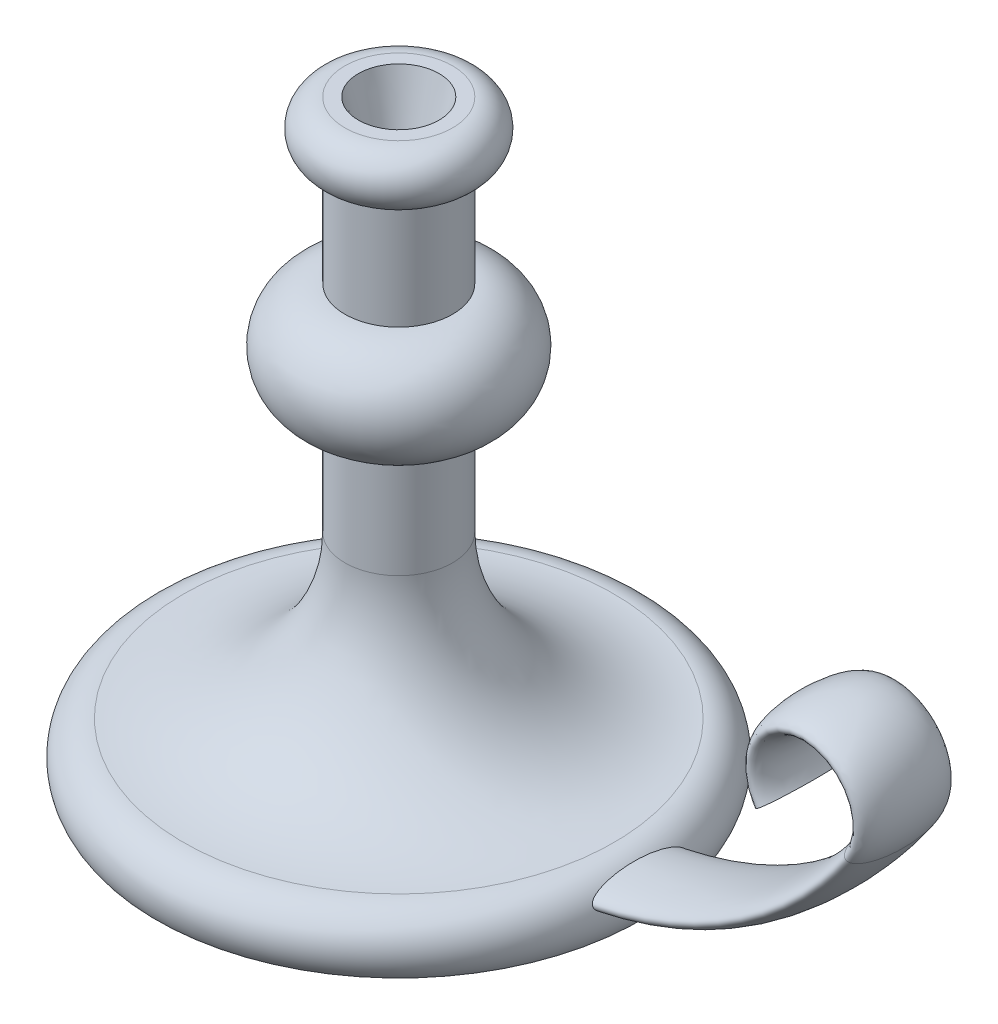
from build123d import *

# Parameters (mm, degrees)
SKETCH3_RX         = 17.5
SKETCH3_RY         = 5
SKETCH4_R          = 15
CUT_EXTRUDE1_DEPTH = 25
CUT_EXTRUDE1_DRAFT = -15


with BuildPart() as part:
    # Sketch1 → Base-Revolve (revolve)
    with BuildSketch(Plane.XY, mode=Mode.PRIVATE) as base_revolve_sk:
        with BuildLine():
            Line((0, 0), (90, 0))
            ThreePointArc((90, 0), (91.180339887, 13.090169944), (80, 20))
            ThreePointArc((80, 20), (37.573593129, 37.573593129), (20, 80))
            Line((20, 80), (20, 120))
            ThreePointArc((20, 120), (40, 140), (20, 160))
            Line((20, 160), (20, 200))
            ThreePointArc((20, 200), (30, 210), (20, 220))
            Line((20, 220), (0, 220))
            Line((0, 220), (0, 0))
        make_face()
    revolve(base_revolve_sk.sketch.rotate(Axis((0, 220, 0), (0, -1, 0)), 180), axis=Axis((0, 220, 0), (0, -1, 0)))

    # Boss-Sweep1: sweep along a path in Sketch2
    with BuildLine(Plane.XY) as boss_sweep1_path:
        Line((0, 10), (60, 10))
        ThreePointArc((60, 10), (129.821200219, 27.240819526), (183.592070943, 75))
        ThreePointArc((183.592070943, 75), (167.113128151, 106.333333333), (150.634185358, 75))
    # Sketch3 → Boss-Sweep1 (sweep)
    with BuildSketch(Plane(origin=(0, 0, 0), x_dir=(0, 0, -1), z_dir=(1, 0, 0))):
        with Locations((0, 10)):
            Ellipse(SKETCH3_RX, SKETCH3_RY)
    sweep(path=boss_sweep1_path.line)


with BuildPart() as cut_extrude1_tool:
    # Sketch4 → Cut-Extrude1 (with draft: the straight prism first)
    with BuildSketch(Plane(origin=(0, 220, 0), x_dir=(-1, 0, 0), z_dir=(0, 1, 0))):
        Circle(SKETCH4_R)
    extrude(amount=-CUT_EXTRUDE1_DEPTH)
    # Cut-Extrude1: the draft: its side faces are tilted about the plane it starts from
    cut_extrude1_sides = [cut_extrude1_tool.faces().sort_by_distance(p)[0] for p in [
        (15, 207.5, 0),
    ]]
    draft(cut_extrude1_sides, Plane(origin=(0, 220, 0), x_dir=(-1, 0, 0), z_dir=(0, 1, 0)), CUT_EXTRUDE1_DRAFT)


with BuildPart() as part_1:
    add(part.part)

    # Cut-Extrude1: cut by cut_extrude1_tool
    add(cut_extrude1_tool.part, mode=Mode.SUBTRACT)


solid = part_1.part
